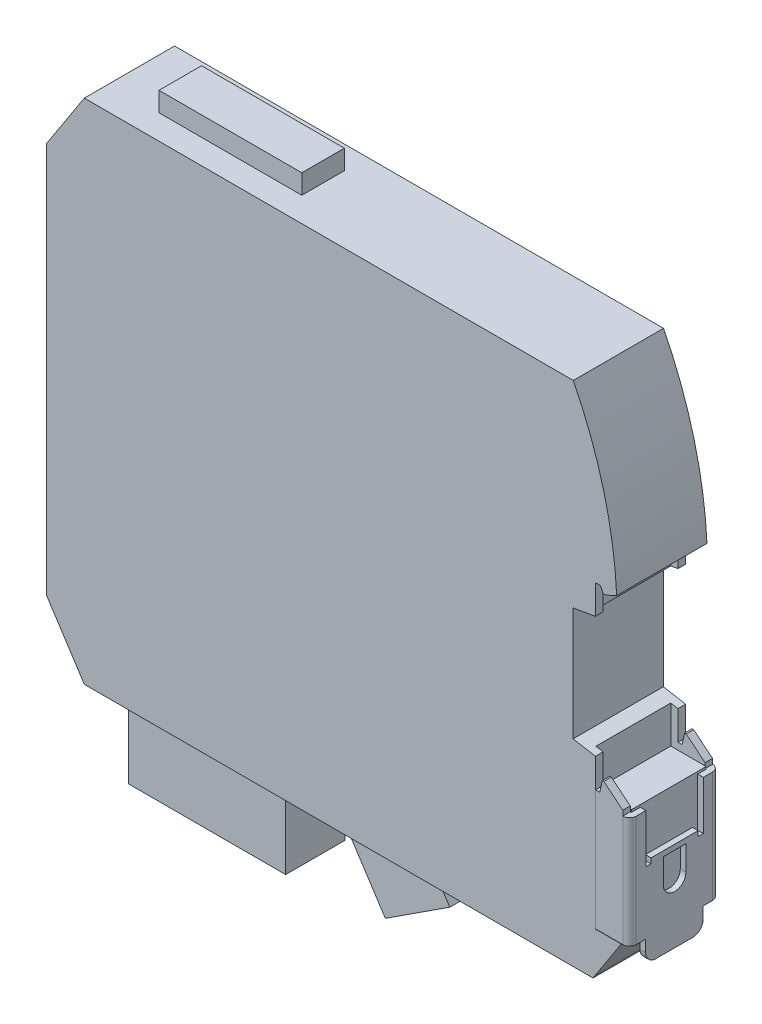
from build123d import *

# Parameters (mm, degrees)
EXTRUDE1_DEPTH  = 8.8
SKETCH2_W       = 30.6
SKETCH2_H       = 5
SKETCH2_H_2     = 1
EXTRUDE2_DEPTH  = 13.5
SKETCH3_W       = 20.03070386
SKETCH3_H       = 1.3
EXTRUDE3_DEPTH  = 20
SKETCH4_W       = 27.85
SKETCH4_H       = 4.5
SKETCH4_H_2     = 4.8
EXTRUDE4_DEPTH  = 3.8
SKETCH5_R       = 1.8
SKETCH5_R_2     = 3.5
EXTRUDE5_DEPTH  = 1
SKETCH6_W       = 6
SKETCH6_H       = 12
SKETCH6_W_2     = 5
SKETCH6_H_2     = 8
EXTRUDE6_DEPTH  = 1
SKETCH8_W       = 22.403875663
SKETCH8_H       = 33.828959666
EXTRUDE7_DEPTH  = 1.1
SKETCH9_W       = 14.6
SKETCH9_H       = 35.25
EXTRUDE8_DEPTH  = 6.7
SKETCH10_W      = 0.05
SKETCH10_H      = 26.539364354
SKETCH10_H_2    = 27.071912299
EXTRUDE9_DEPTH  = 6.6
SKETCH11_W      = 14.6
SKETCH11_H      = 0.45
EXTRUDE10_DEPTH = 0.2
FILLET1_R       = 1.3


with BuildPart() as part:
    # Sketch1 → Extrude1 (new, symmetric)
    with BuildSketch(Plane.XY):
        with BuildLine():
            Line((7.338305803, 99), (0, 87.7))
            Line((0, 87.7), (0, 11.3))
            Line((0, 11.3), (7.338305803, 0))
            Line((7.338305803, 0), (15, 0))
            Line((15, 0), (15, -13.5))
            Line((15, -13.5), (45.6, -13.5))
            Line((45.6, -13.5), (45.6, 0))
            Line((45.6, 0), (57.280711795, 0))
            Line((57.280711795, 0), (64.731357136, -11.472987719))
            Line((64.731357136, -11.472987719), (77.311415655, -3.303402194))
            Line((77.311415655, -3.303402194), (75.166161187, 0))
            Line((75.166161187, 0), (106.525450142, 0))
            Line((106.525450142, 0), (107, 0.730742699))
            Line((107, 0.730742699), (112.050968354, 8.5))
            Line((112.050968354, 8.5), (112.5, 8.5))
            Line((112.5, 8.5), (112.5, 4.2))
            Line((112.5, 4.2), (113.6, 4.2))
            Line((113.6, 4.2), (113.6, 30.2))
            Line((113.6, 30.2), (112.3, 30.2))
            Line((112.3, 30.2), (112.3, 31.2))
            Line((112.3, 31.2), (108.6, 34.2))
            Line((108.6, 34.2), (108.3, 34.2))
            Line((108.3, 34.2), (107.8, 32))
            Line((107.8, 32), (107, 32))
            Line((107, 32), (107, 37.682977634))
            Line((107, 37.682977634), (102.65, 38.45))
            Line((102.65, 38.45), (102.65, 60.55))
            Line((102.65, 60.55), (107, 61.317022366))
            Line((107, 61.317022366), (107, 67))
            Line((107, 67), (108, 67))
            Line((108, 67), (108.512938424, 65.9))
            Line((108.512938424, 65.9), (109, 65.9))
            Line((109, 65.9), (111.154649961, 66.904729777))
            ThreePointArc((111.154649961, 66.904729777), (108.606319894, 83.396072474), (102.692284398, 99))
            Line((102.692284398, 99), (44.95, 99))
            Line((44.95, 99), (44.95, 102.8))
            Line((44.95, 102.8), (17.1, 102.8))
            Line((17.1, 102.8), (17.1, 99))
            Line((17.1, 99), (7.338305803, 99))
        make_face()
    extrude(amount=EXTRUDE1_DEPTH, both=True)

    # Sketch2 → Extrude2 (cut)
    with BuildSketch(Plane.XZ.offset(13.5)):
        with Locations((30.3, -6.3)):
            Rectangle(SKETCH2_W, SKETCH2_H)
        with Locations((30.3, 8.3)):
            Rectangle(SKETCH2_W, SKETCH2_H_2)
    extrude(amount=-EXTRUDE2_DEPTH, mode=Mode.SUBTRACT)

    # Sketch3 → Extrude3 (cut)
    with BuildSketch(Plane.XZ):
        with Locations((67.296063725, 8.15)):
            Rectangle(SKETCH3_W, SKETCH3_H)
        with Locations((67.296063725, -8.15)):
            Rectangle(SKETCH3_W, SKETCH3_H)
    extrude(amount=EXTRUDE3_DEPTH, mode=Mode.SUBTRACT)

    # Sketch4 → Extrude4 (cut)
    with BuildSketch(Plane(origin=(0, 102.8, 0), x_dir=(1, 0, 0), z_dir=(0, 1, 0))):
        with Locations((31.025, 6.55)):
            Rectangle(SKETCH4_W, SKETCH4_H)
        with Locations((31.025, -6.4)):
            Rectangle(SKETCH4_W, SKETCH4_H_2)
    extrude(amount=-EXTRUDE4_DEPTH, mode=Mode.SUBTRACT)

    # Sketch5 → Extrude5 (cut)
    with BuildSketch(Plane.ZY):
        with Locations((-3.1, 79.3)):
            Circle(SKETCH5_R)
        with Locations((-3.1, 74.3)):
            Circle(SKETCH5_R)
        with Locations((0.55, 63.3)):
            Circle(SKETCH5_R_2)
        with Locations((0.55, 54.3)):
            Circle(SKETCH5_R_2)
    extrude(amount=-EXTRUDE5_DEPTH, mode=Mode.SUBTRACT)

    # Sketch6 → Extrude6 (cut)
    with BuildSketch(Plane.ZY):
        with Locations((-0.6, 41.4)):
            Rectangle(SKETCH6_W, SKETCH6_H)
        with Locations((-1.6, 23.4)):
            Rectangle(SKETCH6_W_2, SKETCH6_H_2)
    extrude(amount=-EXTRUDE6_DEPTH, mode=Mode.SUBTRACT)

    # Sketch8 → Extrude7 (cut)
    # profile 1 of 2: a face of its own
    with BuildSketch(Plane(origin=(113.6, 0, -113.6), x_dir=(0, 0, -1), z_dir=(-1, 0, 0))):
        with Locations((-113.984612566, -19.436793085)):
            Rectangle(SKETCH8_W, SKETCH8_H)
        with BuildLine():
            Line((-108.95, -20.7), (-107.95, -20.7))
            Line((-107.95, -20.7), (-107.95, -30.2))
            Line((-107.95, -30.2), (-105.85, -30.2))
            Line((-105.85, -30.2), (-105.85, -31.2))
            Line((-105.85, -31.2), (-105.85, -34.2))
            Line((-105.85, -34.2), (-104.85, -34.2))
            Line((-104.85, -34.2), (-104.85, -31.2))
            Line((-104.85, -31.2), (-104.85, -30.2))
            Line((-104.85, -30.2), (-104.85, -8.5))
            Line((-104.85, -8.5), (-106.15, -8.5))
            Line((-106.15, -8.5), (-108, -8.5))
            Line((-108, -8.5), (-108, -6.2))
            ThreePointArc((-108, -6.2), (-108.585786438, -4.785786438), (-110, -4.2))
            Line((-110, -4.2), (-117.2, -4.2))
            ThreePointArc((-117.2, -4.2), (-118.614213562, -4.785786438), (-119.2, -6.2))
            Line((-119.2, -6.2), (-119.2, -8.5))
            Line((-119.2, -8.5), (-121.05, -8.5))
            Line((-121.05, -8.5), (-122.35, -8.5))
            Line((-122.35, -8.5), (-122.35, -30.2))
            Line((-122.35, -30.2), (-122.35, -31.2))
            Line((-122.35, -31.2), (-122.35, -34.2))
            Line((-122.35, -34.2), (-121.35, -34.2))
            Line((-121.35, -34.2), (-121.35, -31.2))
            Line((-121.35, -31.2), (-121.35, -30.2))
            Line((-121.35, -30.2), (-119.15, -30.2))
            Line((-119.15, -30.2), (-119.15, -20.7))
            Line((-119.15, -20.7), (-118.15, -20.7))
            Line((-118.15, -20.7), (-118.15, -21.7))
            Line((-118.15, -21.7), (-108.95, -21.7))
            Line((-108.95, -21.7), (-108.95, -20.7))
        make_face(mode=Mode.SUBTRACT)
    # profile 2 of 2: a face of its own
    with BuildSketch(Plane(origin=(113.6, 0, -113.6), x_dir=(0, 0, -1), z_dir=(-1, 0, 0))):
        with BuildLine():
            Line((-111.35, -20.7), (-111.35, -15.9))
            ThreePointArc((-111.35, -15.9), (-113.55, -13.7), (-115.75, -15.9))
            Line((-115.75, -15.9), (-115.75, -20.7))
            Line((-115.75, -20.7), (-111.35, -20.7))
        make_face()
    extrude(amount=EXTRUDE7_DEPTH, mode=Mode.SUBTRACT)

    # Sketch9 → Extrude8 (cut)
    with BuildSketch(Plane(origin=(112.3, 0, 0), x_dir=(0, 0, -1), z_dir=(1, 0, 0))):
        with Locations((0, 48.275)):
            Rectangle(SKETCH9_W, SKETCH9_H)
    extrude(amount=-EXTRUDE8_DEPTH, mode=Mode.SUBTRACT)

    # Sketch10 → Extrude9 (cut)
    with BuildSketch(Plane(origin=(113.6, 0, 0), x_dir=(0, 0, -1), z_dir=(1, 0, 0))):
        with Locations((8.775, 21.769682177)):
            Rectangle(SKETCH10_W, SKETCH10_H)
        with Locations((-8.775, 22.03595615)):
            Rectangle(SKETCH10_W, SKETCH10_H_2)
    extrude(amount=-EXTRUDE9_DEPTH, mode=Mode.SUBTRACT)

    # Sketch11 → Extrude10 (add)
    with BuildSketch(Plane(origin=(112.3, 0, 0), x_dir=(0, 0, -1), z_dir=(1, 0, 0))):
        with Locations((0, 30.425)):
            Rectangle(SKETCH11_W, SKETCH11_H)
    extrude(amount=EXTRUDE10_DEPTH)

    # Fillet1
    fillet1_edges = [part.edges().sort_by_distance(p)[0] for p in [
        (113.6, 19.35, -8.75),
        (113.6, 19.35, 8.75),
    ]]
    fillet(fillet1_edges, radius=FILLET1_R)


solid = part.part
